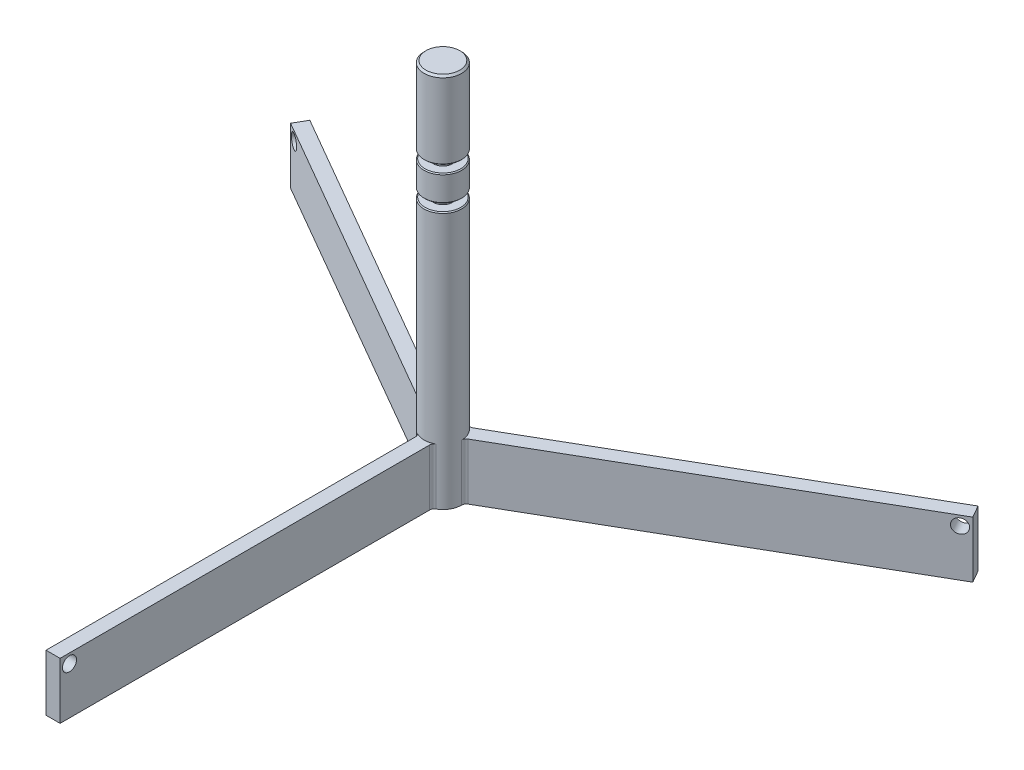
ISO-10303-21;
HEADER;
FILE_DESCRIPTION(('STEP AP214'),'2;1');
FILE_NAME('part.step','',(''),(''),'','','');
FILE_SCHEMA(('AUTOMOTIVE_DESIGN { 1 0 10303 214 1 1 1 1 }'));
ENDSEC;
DATA;
#1=APPLICATION_CONTEXT('core data for automotive mechanical design processes');
#2=APPLICATION_PROTOCOL_DEFINITION('international standard','automotive_design',2000,#1);
#3=PRODUCT_CONTEXT('',#1,'mechanical');
#4=PRODUCT('Part','Part','',(#3));
#5=PRODUCT_RELATED_PRODUCT_CATEGORY('part','',(#4));
#6=PRODUCT_DEFINITION_FORMATION('','',#4);
#7=PRODUCT_DEFINITION_CONTEXT('part definition',#1,'design');
#8=PRODUCT_DEFINITION('design','',#6,#7);
#9=PRODUCT_DEFINITION_SHAPE('','',#8);
#10=(LENGTH_UNIT() NAMED_UNIT(*) SI_UNIT(.MILLI.,.METRE.));
#11=(NAMED_UNIT(*) PLANE_ANGLE_UNIT() SI_UNIT($,.RADIAN.));
#12=(NAMED_UNIT(*) SI_UNIT($,.STERADIAN.) SOLID_ANGLE_UNIT());
#13=UNCERTAINTY_MEASURE_WITH_UNIT(LENGTH_MEASURE(1.E-05),#10,'distance_accuracy_value','');
#14=(GEOMETRIC_REPRESENTATION_CONTEXT(3) GLOBAL_UNCERTAINTY_ASSIGNED_CONTEXT((#13)) GLOBAL_UNIT_ASSIGNED_CONTEXT((#10,
#11,#12)) REPRESENTATION_CONTEXT('',''));
#15=CARTESIAN_POINT('',(0.,0.,0.));
#16=DIRECTION('',(0.,0.,1.));
#17=DIRECTION('',(1.,0.,0.));
#18=AXIS2_PLACEMENT_3D('',#15,#16,#17);
#19=CARTESIAN_POINT('',(0.,112.38552238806,0.));
#20=DIRECTION('',(0.,1.,0.));
#21=DIRECTION('',(0.,0.,1.));
#22=AXIS2_PLACEMENT_3D('',#19,#20,#21);
#23=CYLINDRICAL_SURFACE('',#22,12.7);
#24=CARTESIAN_POINT('',(0.,173.355,0.));
#25=DIRECTION('',(0.,-1.,0.));
#26=DIRECTION('',(0.,0.,-1.));
#27=AXIS2_PLACEMENT_3D('',#24,#25,#26);
#28=CIRCLE('',#27,12.7);
#29=CARTESIAN_POINT('',(0.,173.355,-12.7));
#30=VERTEX_POINT('',#29);
#31=EDGE_CURVE('E317',#30,#30,#28,.T.);
#32=ORIENTED_EDGE('',*,*,#31,.T.);
#33=EDGE_LOOP('',(#32));
#34=FACE_BOUND('',#33,.T.);
#35=CARTESIAN_POINT('',(0.,38.1,0.));
#36=DIRECTION('',(0.,-1.,0.));
#37=DIRECTION('',(0.,0.,-1.));
#38=AXIS2_PLACEMENT_3D('',#35,#36,#37);
#39=CIRCLE('',#38,12.7);
#40=CARTESIAN_POINT('',(6.35000000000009,38.1,-10.9985226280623));
#41=VERTEX_POINT('',#40);
#42=CARTESIAN_POINT('',(12.7,38.1,1.17961196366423E-13));
#43=VERTEX_POINT('',#42);
#44=EDGE_CURVE('E274',#41,#43,#39,.T.);
#45=ORIENTED_EDGE('',*,*,#44,.F.);
#46=DIRECTION('',(0.,1.,0.));
#47=VECTOR('',#46,1.);
#48=CARTESIAN_POINT('',(6.35000000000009,112.38552238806,-10.9985226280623));
#49=LINE('',#48,#47);
#50=CARTESIAN_POINT('',(6.35000000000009,0.,-10.9985226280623));
#51=VERTEX_POINT('',#50);
#52=EDGE_CURVE('E304',#41,#51,#49,.F.);
#53=ORIENTED_EDGE('',*,*,#52,.T.);
#54=CARTESIAN_POINT('',(0.,0.,0.));
#55=DIRECTION('',(0.,1.,0.));
#56=DIRECTION('',(0.,0.,1.));
#57=AXIS2_PLACEMENT_3D('',#54,#55,#56);
#58=CIRCLE('',#57,12.7);
#59=CARTESIAN_POINT('',(-6.34999999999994,0.,-10.9985226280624));
#60=VERTEX_POINT('',#59);
#61=EDGE_CURVE('E239',#51,#60,#58,.T.);
#62=ORIENTED_EDGE('',*,*,#61,.T.);
#63=DIRECTION('',(0.,1.,0.));
#64=VECTOR('',#63,1.);
#65=CARTESIAN_POINT('',(-6.34999999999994,112.38552238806,-10.9985226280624));
#66=LINE('',#65,#64);
#67=CARTESIAN_POINT('',(-6.34999999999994,38.1,-10.9985226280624));
#68=VERTEX_POINT('',#67);
#69=EDGE_CURVE('E280',#60,#68,#66,.T.);
#70=ORIENTED_EDGE('',*,*,#69,.T.);
#71=CARTESIAN_POINT('',(-12.7,38.1,0.));
#72=VERTEX_POINT('',#71);
#73=EDGE_CURVE('E276',#72,#68,#39,.T.);
#74=ORIENTED_EDGE('',*,*,#73,.F.);
#75=DIRECTION('',(0.,1.,0.));
#76=VECTOR('',#75,1.);
#77=CARTESIAN_POINT('',(-12.7,112.38552238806,0.));
#78=LINE('',#77,#76);
#79=CARTESIAN_POINT('',(-12.7,0.,0.));
#80=VERTEX_POINT('',#79);
#81=EDGE_CURVE('E283',#72,#80,#78,.F.);
#82=ORIENTED_EDGE('',*,*,#81,.T.);
#83=CARTESIAN_POINT('',(-6.35,0.,10.9985226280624));
#84=VERTEX_POINT('',#83);
#85=EDGE_CURVE('E234',#80,#84,#58,.T.);
#86=ORIENTED_EDGE('',*,*,#85,.T.);
#87=DIRECTION('',(0.,1.,0.));
#88=VECTOR('',#87,1.);
#89=CARTESIAN_POINT('',(-6.35,112.38552238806,10.9985226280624));
#90=LINE('',#89,#88);
#91=CARTESIAN_POINT('',(-6.35,38.1,10.9985226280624));
#92=VERTEX_POINT('',#91);
#93=EDGE_CURVE('E256',#84,#92,#90,.T.);
#94=ORIENTED_EDGE('',*,*,#93,.T.);
#95=CARTESIAN_POINT('',(0.,38.1,0.));
#96=DIRECTION('',(0.,-1.,0.));
#97=DIRECTION('',(0.,0.,-1.));
#98=AXIS2_PLACEMENT_3D('',#95,#96,#97);
#99=CIRCLE('',#98,12.7);
#100=CARTESIAN_POINT('',(6.35,38.1,10.9985226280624));
#101=VERTEX_POINT('',#100);
#102=EDGE_CURVE('E251',#101,#92,#99,.T.);
#103=ORIENTED_EDGE('',*,*,#102,.F.);
#104=DIRECTION('',(0.,1.,0.));
#105=VECTOR('',#104,1.);
#106=CARTESIAN_POINT('',(6.35,112.38552238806,10.9985226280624));
#107=LINE('',#106,#105);
#108=CARTESIAN_POINT('',(6.35,0.,10.9985226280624));
#109=VERTEX_POINT('',#108);
#110=EDGE_CURVE('E259',#101,#109,#107,.F.);
#111=ORIENTED_EDGE('',*,*,#110,.T.);
#112=CARTESIAN_POINT('',(12.7,0.,1.17961196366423E-13));
#113=VERTEX_POINT('',#112);
#114=EDGE_CURVE('E235',#109,#113,#58,.T.);
#115=ORIENTED_EDGE('',*,*,#114,.T.);
#116=DIRECTION('',(0.,1.,0.));
#117=VECTOR('',#116,1.);
#118=CARTESIAN_POINT('',(12.7,112.38552238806,1.17961196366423E-13));
#119=LINE('',#118,#117);
#120=EDGE_CURVE('E301',#113,#43,#119,.T.);
#121=ORIENTED_EDGE('',*,*,#120,.T.);
#122=EDGE_LOOP('',(#45,#53,#62,#70,#74,#82,#86,#94,#103,#111,#115,#121));
#123=FACE_BOUND('',#122,.T.);
#124=ADVANCED_FACE('F32',(#34,#123),#23,.T.);
#125=CARTESIAN_POINT('',(0.,254.,0.));
#126=DIRECTION('',(0.,-1.,0.));
#127=DIRECTION('',(0.,0.,-1.));
#128=AXIS2_PLACEMENT_3D('',#125,#126,#127);
#129=PLANE('',#128);
#130=CARTESIAN_POINT('',(0.,254.,0.));
#131=DIRECTION('',(0.,-1.,0.));
#132=DIRECTION('',(0.,0.,-1.));
#133=AXIS2_PLACEMENT_3D('',#130,#131,#132);
#134=CIRCLE('',#133,11.43);
#135=CARTESIAN_POINT('',(0.,254.,-11.43));
#136=VERTEX_POINT('',#135);
#137=EDGE_CURVE('E40',#136,#136,#134,.F.);
#138=ORIENTED_EDGE('',*,*,#137,.T.);
#139=EDGE_LOOP('',(#138));
#140=FACE_BOUND('',#139,.T.);
#141=ADVANCED_FACE('F34',(#140),#129,.F.);
#142=CARTESIAN_POINT('',(0.,112.38552238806,0.));
#143=DIRECTION('',(0.,1.,0.));
#144=DIRECTION('',(0.,0.,1.));
#145=AXIS2_PLACEMENT_3D('',#142,#143,#144);
#146=CYLINDRICAL_SURFACE('',#145,12.7);
#147=CARTESIAN_POINT('',(0.,252.73,0.));
#148=DIRECTION('',(0.,-1.,0.));
#149=DIRECTION('',(0.,0.,-1.));
#150=AXIS2_PLACEMENT_3D('',#147,#148,#149);
#151=CIRCLE('',#150,12.7);
#152=CARTESIAN_POINT('',(0.,252.73,-12.7));
#153=VERTEX_POINT('',#152);
#154=EDGE_CURVE('E11',#153,#153,#151,.T.);
#155=ORIENTED_EDGE('',*,*,#154,.T.);
#156=EDGE_LOOP('',(#155));
#157=FACE_BOUND('',#156,.T.);
#158=CARTESIAN_POINT('',(0.,202.311,0.));
#159=DIRECTION('',(0.,1.,0.));
#160=DIRECTION('',(0.,0.,1.));
#161=AXIS2_PLACEMENT_3D('',#158,#159,#160);
#162=CIRCLE('',#161,12.7);
#163=CARTESIAN_POINT('',(0.,202.311,12.7));
#164=VERTEX_POINT('',#163);
#165=EDGE_CURVE('E332',#164,#164,#162,.T.);
#166=ORIENTED_EDGE('',*,*,#165,.T.);
#167=EDGE_LOOP('',(#166));
#168=FACE_BOUND('',#167,.T.);
#169=ADVANCED_FACE('F359',(#157,#168),#146,.T.);
#170=CARTESIAN_POINT('',(6.35,201.676,0.));
#171=DIRECTION('',(0.,1.,0.));
#172=DIRECTION('',(0.,0.,1.));
#173=AXIS2_PLACEMENT_3D('',#170,#171,#172);
#174=PLANE('',#173);
#175=CARTESIAN_POINT('',(0.,201.676,0.));
#176=DIRECTION('',(0.,1.,0.));
#177=DIRECTION('',(0.,0.,1.));
#178=AXIS2_PLACEMENT_3D('',#175,#176,#177);
#179=CIRCLE('',#178,12.065);
#180=CARTESIAN_POINT('',(0.,201.676,12.065));
#181=VERTEX_POINT('',#180);
#182=EDGE_CURVE('E335',#181,#181,#179,.F.);
#183=ORIENTED_EDGE('',*,*,#182,.T.);
#184=EDGE_LOOP('',(#183));
#185=FACE_BOUND('',#184,.T.);
#186=CARTESIAN_POINT('',(0.,201.676,0.));
#187=DIRECTION('',(0.,1.,0.));
#188=DIRECTION('',(0.,0.,1.));
#189=AXIS2_PLACEMENT_3D('',#186,#187,#188);
#190=CIRCLE('',#189,6.35);
#191=CARTESIAN_POINT('',(0.,201.676,6.35));
#192=VERTEX_POINT('',#191);
#193=EDGE_CURVE('E248',#192,#192,#190,.T.);
#194=ORIENTED_EDGE('',*,*,#193,.T.);
#195=EDGE_LOOP('',(#194));
#196=FACE_BOUND('',#195,.T.);
#197=ADVANCED_FACE('F387',(#185,#196),#174,.F.);
#198=CARTESIAN_POINT('',(0.,112.38552238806,0.));
#199=DIRECTION('',(0.,1.,0.));
#200=DIRECTION('',(0.,0.,1.));
#201=AXIS2_PLACEMENT_3D('',#198,#199,#200);
#202=CYLINDRICAL_SURFACE('',#201,6.35);
#203=ORIENTED_EDGE('',*,*,#193,.F.);
#204=EDGE_LOOP('',(#203));
#205=FACE_BOUND('',#204,.T.);
#206=CARTESIAN_POINT('',(0.,196.596,0.));
#207=DIRECTION('',(0.,1.,0.));
#208=DIRECTION('',(0.,0.,1.));
#209=AXIS2_PLACEMENT_3D('',#206,#207,#208);
#210=CIRCLE('',#209,6.35);
#211=CARTESIAN_POINT('',(0.,196.596,6.35));
#212=VERTEX_POINT('',#211);
#213=EDGE_CURVE('E245',#212,#212,#210,.T.);
#214=ORIENTED_EDGE('',*,*,#213,.T.);
#215=EDGE_LOOP('',(#214));
#216=FACE_BOUND('',#215,.T.);
#217=ADVANCED_FACE('F383',(#205,#216),#202,.T.);
#218=CARTESIAN_POINT('',(12.7,196.596,0.));
#219=DIRECTION('',(0.,-1.,0.));
#220=DIRECTION('',(0.,0.,-1.));
#221=AXIS2_PLACEMENT_3D('',#218,#219,#220);
#222=PLANE('',#221);
#223=CARTESIAN_POINT('',(0.,196.596,0.));
#224=DIRECTION('',(0.,-1.,0.));
#225=DIRECTION('',(0.,0.,-1.));
#226=AXIS2_PLACEMENT_3D('',#223,#224,#225);
#227=CIRCLE('',#226,12.065);
#228=CARTESIAN_POINT('',(0.,196.596,-12.065));
#229=VERTEX_POINT('',#228);
#230=EDGE_CURVE('E329',#229,#229,#227,.F.);
#231=ORIENTED_EDGE('',*,*,#230,.T.);
#232=EDGE_LOOP('',(#231));
#233=FACE_BOUND('',#232,.T.);
#234=ORIENTED_EDGE('',*,*,#213,.F.);
#235=EDGE_LOOP('',(#234));
#236=FACE_BOUND('',#235,.T.);
#237=ADVANCED_FACE('F379',(#233,#236),#222,.F.);
#238=CARTESIAN_POINT('',(0.,112.38552238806,0.));
#239=DIRECTION('',(0.,1.,0.));
#240=DIRECTION('',(0.,0.,1.));
#241=AXIS2_PLACEMENT_3D('',#238,#239,#240);
#242=CYLINDRICAL_SURFACE('',#241,12.7);
#243=CARTESIAN_POINT('',(0.,179.705,0.));
#244=DIRECTION('',(0.,1.,0.));
#245=DIRECTION('',(0.,0.,1.));
#246=AXIS2_PLACEMENT_3D('',#243,#244,#245);
#247=CIRCLE('',#246,12.7);
#248=CARTESIAN_POINT('',(0.,179.705,12.7));
#249=VERTEX_POINT('',#248);
#250=EDGE_CURVE('E323',#249,#249,#247,.T.);
#251=ORIENTED_EDGE('',*,*,#250,.T.);
#252=EDGE_LOOP('',(#251));
#253=FACE_BOUND('',#252,.T.);
#254=CARTESIAN_POINT('',(0.,195.961,0.));
#255=DIRECTION('',(0.,-1.,0.));
#256=DIRECTION('',(0.,0.,-1.));
#257=AXIS2_PLACEMENT_3D('',#254,#255,#256);
#258=CIRCLE('',#257,12.7);
#259=CARTESIAN_POINT('',(0.,195.961,-12.7));
#260=VERTEX_POINT('',#259);
#261=EDGE_CURVE('E320',#260,#260,#258,.T.);
#262=ORIENTED_EDGE('',*,*,#261,.T.);
#263=EDGE_LOOP('',(#262));
#264=FACE_BOUND('',#263,.T.);
#265=ADVANCED_FACE('F375',(#253,#264),#242,.T.);
#266=CARTESIAN_POINT('',(6.35,179.07,0.));
#267=DIRECTION('',(0.,1.,0.));
#268=DIRECTION('',(0.,0.,1.));
#269=AXIS2_PLACEMENT_3D('',#266,#267,#268);
#270=PLANE('',#269);
#271=CARTESIAN_POINT('',(0.,179.07,0.));
#272=DIRECTION('',(0.,1.,0.));
#273=DIRECTION('',(0.,0.,1.));
#274=AXIS2_PLACEMENT_3D('',#271,#272,#273);
#275=CIRCLE('',#274,12.065);
#276=CARTESIAN_POINT('',(0.,179.07,12.065));
#277=VERTEX_POINT('',#276);
#278=EDGE_CURVE('E326',#277,#277,#275,.F.);
#279=ORIENTED_EDGE('',*,*,#278,.T.);
#280=EDGE_LOOP('',(#279));
#281=FACE_BOUND('',#280,.T.);
#282=CARTESIAN_POINT('',(0.,179.07,0.));
#283=DIRECTION('',(0.,1.,0.));
#284=DIRECTION('',(0.,0.,1.));
#285=AXIS2_PLACEMENT_3D('',#282,#283,#284);
#286=CIRCLE('',#285,6.35);
#287=CARTESIAN_POINT('',(0.,179.07,6.35));
#288=VERTEX_POINT('',#287);
#289=EDGE_CURVE('E242',#288,#288,#286,.T.);
#290=ORIENTED_EDGE('',*,*,#289,.T.);
#291=EDGE_LOOP('',(#290));
#292=FACE_BOUND('',#291,.T.);
#293=ADVANCED_FACE('F371',(#281,#292),#270,.F.);
#294=CARTESIAN_POINT('',(0.,112.38552238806,0.));
#295=DIRECTION('',(0.,1.,0.));
#296=DIRECTION('',(0.,0.,1.));
#297=AXIS2_PLACEMENT_3D('',#294,#295,#296);
#298=CYLINDRICAL_SURFACE('',#297,6.35);
#299=ORIENTED_EDGE('',*,*,#289,.F.);
#300=EDGE_LOOP('',(#299));
#301=FACE_BOUND('',#300,.T.);
#302=CARTESIAN_POINT('',(0.,173.99,0.));
#303=DIRECTION('',(0.,1.,0.));
#304=DIRECTION('',(0.,0.,1.));
#305=AXIS2_PLACEMENT_3D('',#302,#303,#304);
#306=CIRCLE('',#305,6.35);
#307=CARTESIAN_POINT('',(0.,173.99,6.35));
#308=VERTEX_POINT('',#307);
#309=EDGE_CURVE('E238',#308,#308,#306,.T.);
#310=ORIENTED_EDGE('',*,*,#309,.T.);
#311=EDGE_LOOP('',(#310));
#312=FACE_BOUND('',#311,.T.);
#313=ADVANCED_FACE('F367',(#301,#312),#298,.T.);
#314=CARTESIAN_POINT('',(12.7,173.99,0.));
#315=DIRECTION('',(0.,-1.,0.));
#316=DIRECTION('',(0.,0.,-1.));
#317=AXIS2_PLACEMENT_3D('',#314,#315,#316);
#318=PLANE('',#317);
#319=CARTESIAN_POINT('',(0.,173.99,0.));
#320=DIRECTION('',(0.,-1.,0.));
#321=DIRECTION('',(0.,0.,-1.));
#322=AXIS2_PLACEMENT_3D('',#319,#320,#321);
#323=CIRCLE('',#322,12.065);
#324=CARTESIAN_POINT('',(0.,173.99,-12.065));
#325=VERTEX_POINT('',#324);
#326=EDGE_CURVE('E314',#325,#325,#323,.F.);
#327=ORIENTED_EDGE('',*,*,#326,.T.);
#328=EDGE_LOOP('',(#327));
#329=FACE_BOUND('',#328,.T.);
#330=ORIENTED_EDGE('',*,*,#309,.F.);
#331=EDGE_LOOP('',(#330));
#332=FACE_BOUND('',#331,.T.);
#333=ADVANCED_FACE('F364',(#329,#332),#318,.F.);
#334=CARTESIAN_POINT('',(0.,0.,0.));
#335=DIRECTION('',(0.,1.,0.));
#336=DIRECTION('',(0.,0.,1.));
#337=AXIS2_PLACEMENT_3D('',#334,#335,#336);
#338=PLANE('',#337);
#339=ORIENTED_EDGE('',*,*,#85,.F.);
#340=CARTESIAN_POINT('',(-15.875,0.,0.));
#341=DIRECTION('',(0.,1.,0.));
#342=DIRECTION('',(0.,0.,1.));
#343=AXIS2_PLACEMENT_3D('',#340,#341,#342);
#344=CIRCLE('',#343,3.175);
#345=CARTESIAN_POINT('',(-14.2875,0.,-2.74963065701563));
#346=VERTEX_POINT('',#345);
#347=EDGE_CURVE('E291',#80,#346,#344,.T.);
#348=ORIENTED_EDGE('',*,*,#347,.T.);
#349=DIRECTION('',(0.866025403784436,0.,0.500000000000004));
#350=VECTOR('',#349,1.);
#351=CARTESIAN_POINT('',(-230.600594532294,0.,-127.638054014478));
#352=LINE('',#351,#350);
#353=CARTESIAN_POINT('',(-230.600594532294,0.,-127.638054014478));
#354=VERTEX_POINT('',#353);
#355=EDGE_CURVE('E201',#354,#346,#352,.T.);
#356=ORIENTED_EDGE('',*,*,#355,.F.);
#357=DIRECTION('',(-0.500000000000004,0.,0.866025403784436));
#358=VECTOR('',#357,1.);
#359=CARTESIAN_POINT('',(-225.838094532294,0.,-135.886945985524));
#360=LINE('',#359,#358);
#361=CARTESIAN_POINT('',(-225.838094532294,0.,-135.886945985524));
#362=VERTEX_POINT('',#361);
#363=EDGE_CURVE('E184',#362,#354,#360,.T.);
#364=ORIENTED_EDGE('',*,*,#363,.F.);
#365=DIRECTION('',(0.866025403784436,0.,0.500000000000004));
#366=VECTOR('',#365,1.);
#367=CARTESIAN_POINT('',(-225.838094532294,0.,-135.886945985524));
#368=LINE('',#367,#366);
#369=CARTESIAN_POINT('',(-9.5249999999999,0.,-10.9985226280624));
#370=VERTEX_POINT('',#369);
#371=EDGE_CURVE('E204',#362,#370,#368,.T.);
#372=ORIENTED_EDGE('',*,*,#371,.T.);
#373=CARTESIAN_POINT('',(-7.93749999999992,0.,-13.748153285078));
#374=DIRECTION('',(0.,1.,0.));
#375=DIRECTION('',(0.,0.,1.));
#376=AXIS2_PLACEMENT_3D('',#373,#374,#375);
#377=CIRCLE('',#376,3.175);
#378=EDGE_CURVE('E293',#370,#60,#377,.T.);
#379=ORIENTED_EDGE('',*,*,#378,.T.);
#380=ORIENTED_EDGE('',*,*,#61,.F.);
#381=CARTESIAN_POINT('',(7.93750000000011,0.,-13.7481532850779));
#382=DIRECTION('',(0.,1.,0.));
#383=DIRECTION('',(0.,0.,1.));
#384=AXIS2_PLACEMENT_3D('',#381,#382,#383);
#385=CIRCLE('',#384,3.175);
#386=CARTESIAN_POINT('',(9.52500000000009,0.,-10.9985226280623));
#387=VERTEX_POINT('',#386);
#388=EDGE_CURVE('E310',#51,#387,#385,.T.);
#389=ORIENTED_EDGE('',*,*,#388,.T.);
#390=DIRECTION('',(-0.866025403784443,0.,0.499999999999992));
#391=VECTOR('',#390,1.);
#392=CARTESIAN_POINT('',(225.838094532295,0.,-135.886945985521));
#393=LINE('',#392,#391);
#394=CARTESIAN_POINT('',(225.838094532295,0.,-135.886945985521));
#395=VERTEX_POINT('',#394);
#396=EDGE_CURVE('E166',#395,#387,#393,.T.);
#397=ORIENTED_EDGE('',*,*,#396,.F.);
#398=DIRECTION('',(-0.499999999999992,0.,-0.866025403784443));
#399=VECTOR('',#398,1.);
#400=CARTESIAN_POINT('',(230.600594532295,0.,-127.638054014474));
#401=LINE('',#400,#399);
#402=CARTESIAN_POINT('',(230.600594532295,0.,-127.638054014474));
#403=VERTEX_POINT('',#402);
#404=EDGE_CURVE('E159',#403,#395,#401,.T.);
#405=ORIENTED_EDGE('',*,*,#404,.F.);
#406=DIRECTION('',(-0.866025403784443,0.,0.499999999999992));
#407=VECTOR('',#406,1.);
#408=CARTESIAN_POINT('',(230.600594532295,0.,-127.638054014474));
#409=LINE('',#408,#407);
#410=CARTESIAN_POINT('',(14.2875,0.,-2.74963065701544));
#411=VERTEX_POINT('',#410);
#412=EDGE_CURVE('E164',#403,#411,#409,.T.);
#413=ORIENTED_EDGE('',*,*,#412,.T.);
#414=CARTESIAN_POINT('',(15.875,0.,1.47451495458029E-13));
#415=DIRECTION('',(0.,1.,0.));
#416=DIRECTION('',(0.,0.,1.));
#417=AXIS2_PLACEMENT_3D('',#414,#415,#416);
#418=CIRCLE('',#417,3.175);
#419=EDGE_CURVE('E47',#411,#113,#418,.T.);
#420=ORIENTED_EDGE('',*,*,#419,.T.);
#421=ORIENTED_EDGE('',*,*,#114,.F.);
#422=CARTESIAN_POINT('',(7.9375,0.,13.748153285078));
#423=DIRECTION('',(0.,1.,0.));
#424=DIRECTION('',(0.,0.,1.));
#425=AXIS2_PLACEMENT_3D('',#422,#423,#424);
#426=CIRCLE('',#425,3.175);
#427=CARTESIAN_POINT('',(4.7625,0.,13.748153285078));
#428=VERTEX_POINT('',#427);
#429=EDGE_CURVE('E267',#109,#428,#426,.T.);
#430=ORIENTED_EDGE('',*,*,#429,.T.);
#431=DIRECTION('',(0.,0.,-1.));
#432=VECTOR('',#431,1.);
#433=CARTESIAN_POINT('',(4.7625,0.,263.525));
#434=LINE('',#433,#432);
#435=CARTESIAN_POINT('',(4.7625,0.,263.525));
#436=VERTEX_POINT('',#435);
#437=EDGE_CURVE('E228',#436,#428,#434,.T.);
#438=ORIENTED_EDGE('',*,*,#437,.F.);
#439=DIRECTION('',(1.,0.,0.));
#440=VECTOR('',#439,1.);
#441=CARTESIAN_POINT('',(-4.7625,0.,263.525));
#442=LINE('',#441,#440);
#443=CARTESIAN_POINT('',(-4.7625,0.,263.525));
#444=VERTEX_POINT('',#443);
#445=EDGE_CURVE('E216',#444,#436,#442,.T.);
#446=ORIENTED_EDGE('',*,*,#445,.F.);
#447=DIRECTION('',(0.,0.,-1.));
#448=VECTOR('',#447,1.);
#449=CARTESIAN_POINT('',(-4.7625,0.,263.525));
#450=LINE('',#449,#448);
#451=CARTESIAN_POINT('',(-4.7625,0.,13.748153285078));
#452=VERTEX_POINT('',#451);
#453=EDGE_CURVE('E231',#444,#452,#450,.T.);
#454=ORIENTED_EDGE('',*,*,#453,.T.);
#455=CARTESIAN_POINT('',(-7.9375,0.,13.748153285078));
#456=DIRECTION('',(0.,1.,0.));
#457=DIRECTION('',(0.,0.,1.));
#458=AXIS2_PLACEMENT_3D('',#455,#456,#457);
#459=CIRCLE('',#458,3.175);
#460=EDGE_CURVE('E269',#452,#84,#459,.T.);
#461=ORIENTED_EDGE('',*,*,#460,.T.);
#462=EDGE_LOOP('',(#339,#348,#356,#364,#372,#379,#380,#389,#397,#405,#413,#420,#421,#430,#438,
#446,#454,#461));
#463=FACE_BOUND('',#462,.T.);
#464=ADVANCED_FACE('F162',(#463),#338,.F.);
#465=CARTESIAN_POINT('',(-4.7625,38.1,263.525));
#466=DIRECTION('',(0.,-1.,0.));
#467=DIRECTION('',(0.,0.,-1.));
#468=AXIS2_PLACEMENT_3D('',#465,#466,#467);
#469=PLANE('',#468);
#470=DIRECTION('',(0.,0.,-1.));
#471=VECTOR('',#470,1.);
#472=CARTESIAN_POINT('',(4.7625,38.1,263.525));
#473=LINE('',#472,#471);
#474=CARTESIAN_POINT('',(4.7625,38.1,263.525));
#475=VERTEX_POINT('',#474);
#476=CARTESIAN_POINT('',(4.7625,38.1,13.748153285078));
#477=VERTEX_POINT('',#476);
#478=EDGE_CURVE('E225',#475,#477,#473,.T.);
#479=ORIENTED_EDGE('',*,*,#478,.T.);
#480=CARTESIAN_POINT('',(7.9375,38.1,13.748153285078));
#481=DIRECTION('',(0.,-1.,0.));
#482=DIRECTION('',(0.,0.,-1.));
#483=AXIS2_PLACEMENT_3D('',#480,#481,#482);
#484=CIRCLE('',#483,3.175);
#485=EDGE_CURVE('E264',#477,#101,#484,.T.);
#486=ORIENTED_EDGE('',*,*,#485,.T.);
#487=ORIENTED_EDGE('',*,*,#102,.T.);
#488=CARTESIAN_POINT('',(-7.9375,38.1,13.748153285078));
#489=DIRECTION('',(0.,-1.,0.));
#490=DIRECTION('',(0.,0.,-1.));
#491=AXIS2_PLACEMENT_3D('',#488,#489,#490);
#492=CIRCLE('',#491,3.175);
#493=CARTESIAN_POINT('',(-4.7625,38.1,13.748153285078));
#494=VERTEX_POINT('',#493);
#495=EDGE_CURVE('E272',#92,#494,#492,.T.);
#496=ORIENTED_EDGE('',*,*,#495,.T.);
#497=DIRECTION('',(0.,0.,-1.));
#498=VECTOR('',#497,1.);
#499=CARTESIAN_POINT('',(-4.7625,38.1,263.525));
#500=LINE('',#499,#498);
#501=CARTESIAN_POINT('',(-4.7625,38.1,263.525));
#502=VERTEX_POINT('',#501);
#503=EDGE_CURVE('E222',#502,#494,#500,.T.);
#504=ORIENTED_EDGE('',*,*,#503,.F.);
#505=DIRECTION('',(-1.,0.,0.));
#506=VECTOR('',#505,1.);
#507=CARTESIAN_POINT('',(-4.7625,38.1,263.525));
#508=LINE('',#507,#506);
#509=EDGE_CURVE('E220',#475,#502,#508,.T.);
#510=ORIENTED_EDGE('',*,*,#509,.F.);
#511=EDGE_LOOP('',(#479,#486,#487,#496,#504,#510));
#512=FACE_BOUND('',#511,.T.);
#513=ADVANCED_FACE('F436',(#512),#469,.F.);
#514=CARTESIAN_POINT('',(-4.7625,0.,263.525));
#515=DIRECTION('',(1.,0.,0.));
#516=DIRECTION('',(0.,1.,0.));
#517=AXIS2_PLACEMENT_3D('',#514,#515,#516);
#518=PLANE('',#517);
#519=CARTESIAN_POINT('',(-4.7625,31.75,257.175));
#520=DIRECTION('',(1.,0.,0.));
#521=DIRECTION('',(0.,1.,0.));
#522=AXIS2_PLACEMENT_3D('',#519,#520,#521);
#523=CIRCLE('',#522,4.76250000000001);
#524=CARTESIAN_POINT('',(-4.7625,36.5125,257.175));
#525=VERTEX_POINT('',#524);
#526=EDGE_CURVE('E210',#525,#525,#523,.T.);
#527=ORIENTED_EDGE('',*,*,#526,.T.);
#528=EDGE_LOOP('',(#527));
#529=FACE_BOUND('',#528,.T.);
#530=ORIENTED_EDGE('',*,*,#503,.T.);
#531=DIRECTION('',(0.,-1.,0.));
#532=VECTOR('',#531,1.);
#533=CARTESIAN_POINT('',(-4.7625,0.,13.748153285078));
#534=LINE('',#533,#532);
#535=EDGE_CURVE('E261',#494,#452,#534,.T.);
#536=ORIENTED_EDGE('',*,*,#535,.T.);
#537=ORIENTED_EDGE('',*,*,#453,.F.);
#538=DIRECTION('',(0.,-1.,0.));
#539=VECTOR('',#538,1.);
#540=CARTESIAN_POINT('',(-4.7625,0.,263.525));
#541=LINE('',#540,#539);
#542=EDGE_CURVE('E213',#502,#444,#541,.T.);
#543=ORIENTED_EDGE('',*,*,#542,.F.);
#544=EDGE_LOOP('',(#530,#536,#537,#543));
#545=FACE_BOUND('',#544,.T.);
#546=ADVANCED_FACE('F444',(#529,#545),#518,.F.);
#547=CARTESIAN_POINT('',(4.7625,0.,263.525));
#548=DIRECTION('',(-1.,0.,0.));
#549=DIRECTION('',(0.,-1.,0.));
#550=AXIS2_PLACEMENT_3D('',#547,#548,#549);
#551=PLANE('',#550);
#552=CARTESIAN_POINT('',(4.7625,31.75,257.175));
#553=DIRECTION('',(1.,0.,0.));
#554=DIRECTION('',(0.,1.,0.));
#555=AXIS2_PLACEMENT_3D('',#552,#553,#554);
#556=CIRCLE('',#555,4.76250000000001);
#557=CARTESIAN_POINT('',(4.7625,36.5125,257.175));
#558=VERTEX_POINT('',#557);
#559=EDGE_CURVE('E207',#558,#558,#556,.T.);
#560=ORIENTED_EDGE('',*,*,#559,.F.);
#561=EDGE_LOOP('',(#560));
#562=FACE_BOUND('',#561,.T.);
#563=ORIENTED_EDGE('',*,*,#437,.T.);
#564=DIRECTION('',(0.,-1.,0.));
#565=VECTOR('',#564,1.);
#566=CARTESIAN_POINT('',(4.7625,38.1,13.748153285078));
#567=LINE('',#566,#565);
#568=EDGE_CURVE('E253',#428,#477,#567,.F.);
#569=ORIENTED_EDGE('',*,*,#568,.T.);
#570=ORIENTED_EDGE('',*,*,#478,.F.);
#571=DIRECTION('',(0.,1.,0.));
#572=VECTOR('',#571,1.);
#573=CARTESIAN_POINT('',(4.7625,0.,263.525));
#574=LINE('',#573,#572);
#575=EDGE_CURVE('E218',#436,#475,#574,.T.);
#576=ORIENTED_EDGE('',*,*,#575,.F.);
#577=EDGE_LOOP('',(#563,#569,#570,#576));
#578=FACE_BOUND('',#577,.T.);
#579=ADVANCED_FACE('F453',(#562,#578),#551,.F.);
#580=CARTESIAN_POINT('',(-4.7625,38.1,263.525));
#581=DIRECTION('',(0.,0.,-1.));
#582=DIRECTION('',(-1.,0.,0.));
#583=AXIS2_PLACEMENT_3D('',#580,#581,#582);
#584=PLANE('',#583);
#585=ORIENTED_EDGE('',*,*,#542,.T.);
#586=ORIENTED_EDGE('',*,*,#445,.T.);
#587=ORIENTED_EDGE('',*,*,#575,.T.);
#588=ORIENTED_EDGE('',*,*,#509,.T.);
#589=EDGE_LOOP('',(#585,#586,#587,#588));
#590=FACE_BOUND('',#589,.T.);
#591=ADVANCED_FACE('F460',(#590),#584,.F.);
#592=CARTESIAN_POINT('',(-12.7,31.75,257.175));
#593=DIRECTION('',(1.,0.,0.));
#594=DIRECTION('',(0.,1.,0.));
#595=AXIS2_PLACEMENT_3D('',#592,#593,#594);
#596=CYLINDRICAL_SURFACE('',#595,4.76250000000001);
#597=ORIENTED_EDGE('',*,*,#559,.T.);
#598=EDGE_LOOP('',(#597));
#599=FACE_BOUND('',#598,.T.);
#600=ORIENTED_EDGE('',*,*,#526,.F.);
#601=EDGE_LOOP('',(#600));
#602=FACE_BOUND('',#601,.T.);
#603=ADVANCED_FACE('F468',(#599,#602),#596,.F.);
#604=CARTESIAN_POINT('',(7.9375,112.38552238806,13.748153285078));
#605=DIRECTION('',(0.,1.,0.));
#606=DIRECTION('',(0.,0.,1.));
#607=AXIS2_PLACEMENT_3D('',#604,#605,#606);
#608=CYLINDRICAL_SURFACE('',#607,3.175);
#609=ORIENTED_EDGE('',*,*,#429,.F.);
#610=ORIENTED_EDGE('',*,*,#110,.F.);
#611=ORIENTED_EDGE('',*,*,#485,.F.);
#612=ORIENTED_EDGE('',*,*,#568,.F.);
#613=EDGE_LOOP('',(#609,#610,#611,#612));
#614=FACE_BOUND('',#613,.T.);
#615=ADVANCED_FACE('F475',(#614),#608,.F.);
#616=CARTESIAN_POINT('',(-7.9375,112.38552238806,13.748153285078));
#617=DIRECTION('',(0.,1.,0.));
#618=DIRECTION('',(0.,0.,1.));
#619=AXIS2_PLACEMENT_3D('',#616,#617,#618);
#620=CYLINDRICAL_SURFACE('',#619,3.175);
#621=ORIENTED_EDGE('',*,*,#495,.F.);
#622=ORIENTED_EDGE('',*,*,#93,.F.);
#623=ORIENTED_EDGE('',*,*,#460,.F.);
#624=ORIENTED_EDGE('',*,*,#535,.F.);
#625=EDGE_LOOP('',(#621,#622,#623,#624));
#626=FACE_BOUND('',#625,.T.);
#627=ADVANCED_FACE('F482',(#626),#620,.F.);
#628=CARTESIAN_POINT('',(230.600594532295,38.1,-127.638054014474));
#629=DIRECTION('',(-0.866025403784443,0.,0.499999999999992));
#630=DIRECTION('',(0.499999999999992,0.,0.866025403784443));
#631=AXIS2_PLACEMENT_3D('',#628,#629,#630);
#632=PLANE('',#631);
#633=DIRECTION('',(0.,-1.,0.));
#634=VECTOR('',#633,1.);
#635=CARTESIAN_POINT('',(230.600594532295,0.,-127.638054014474));
#636=LINE('',#635,#634);
#637=CARTESIAN_POINT('',(230.600594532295,38.1,-127.638054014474));
#638=VERTEX_POINT('',#637);
#639=EDGE_CURVE('E170',#638,#403,#636,.T.);
#640=ORIENTED_EDGE('',*,*,#639,.T.);
#641=ORIENTED_EDGE('',*,*,#404,.T.);
#642=DIRECTION('',(0.,1.,0.));
#643=VECTOR('',#642,1.);
#644=CARTESIAN_POINT('',(225.838094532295,0.,-135.886945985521));
#645=LINE('',#644,#643);
#646=CARTESIAN_POINT('',(225.838094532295,38.1,-135.886945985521));
#647=VERTEX_POINT('',#646);
#648=EDGE_CURVE('E169',#395,#647,#645,.T.);
#649=ORIENTED_EDGE('',*,*,#648,.T.);
#650=DIRECTION('',(0.499999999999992,0.,0.866025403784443));
#651=VECTOR('',#650,1.);
#652=CARTESIAN_POINT('',(230.600594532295,38.1,-127.638054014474));
#653=LINE('',#652,#651);
#654=EDGE_CURVE('E175',#647,#638,#653,.T.);
#655=ORIENTED_EDGE('',*,*,#654,.T.);
#656=EDGE_LOOP('',(#640,#641,#649,#655));
#657=FACE_BOUND('',#656,.T.);
#658=ADVANCED_FACE('F173',(#657),#632,.F.);
#659=CARTESIAN_POINT('',(230.600594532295,0.,-127.638054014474));
#660=DIRECTION('',(-0.499999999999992,0.,-0.866025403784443));
#661=DIRECTION('',(-0.866025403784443,0.,0.499999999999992));
#662=AXIS2_PLACEMENT_3D('',#659,#660,#661);
#663=PLANE('',#662);
#664=CARTESIAN_POINT('',(225.101333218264,31.75,-124.463054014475));
#665=DIRECTION('',(-0.499999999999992,0.,-0.866025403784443));
#666=DIRECTION('',(-0.866025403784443,0.,0.499999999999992));
#667=AXIS2_PLACEMENT_3D('',#664,#665,#666);
#668=CIRCLE('',#667,4.76250000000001);
#669=CARTESIAN_POINT('',(220.976887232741,31.75,-122.081804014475));
#670=VERTEX_POINT('',#669);
#671=EDGE_CURVE('E784',#670,#670,#668,.T.);
#672=ORIENTED_EDGE('',*,*,#671,.T.);
#673=EDGE_LOOP('',(#672));
#674=FACE_BOUND('',#673,.T.);
#675=DIRECTION('',(-0.866025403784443,0.,0.499999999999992));
#676=VECTOR('',#675,1.);
#677=CARTESIAN_POINT('',(230.600594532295,38.1,-127.638054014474));
#678=LINE('',#677,#676);
#679=CARTESIAN_POINT('',(14.2875,38.1,-2.74963065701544));
#680=VERTEX_POINT('',#679);
#681=EDGE_CURVE('E774',#638,#680,#678,.T.);
#682=ORIENTED_EDGE('',*,*,#681,.T.);
#683=DIRECTION('',(0.,-1.,0.));
#684=VECTOR('',#683,1.);
#685=CARTESIAN_POINT('',(14.2875,0.,-2.74963065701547));
#686=LINE('',#685,#684);
#687=EDGE_CURVE('E180',#680,#411,#686,.T.);
#688=ORIENTED_EDGE('',*,*,#687,.T.);
#689=ORIENTED_EDGE('',*,*,#412,.F.);
#690=ORIENTED_EDGE('',*,*,#639,.F.);
#691=EDGE_LOOP('',(#682,#688,#689,#690));
#692=FACE_BOUND('',#691,.T.);
#693=ADVANCED_FACE('F179',(#674,#692),#663,.F.);
#694=CARTESIAN_POINT('',(225.838094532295,0.,-135.886945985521));
#695=DIRECTION('',(0.499999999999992,0.,0.866025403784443));
#696=DIRECTION('',(0.866025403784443,0.,-0.499999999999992));
#697=AXIS2_PLACEMENT_3D('',#694,#695,#696);
#698=PLANE('',#697);
#699=CARTESIAN_POINT('',(220.338833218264,31.75,-132.711945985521));
#700=DIRECTION('',(-0.499999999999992,0.,-0.866025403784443));
#701=DIRECTION('',(0.,1.,0.));
#702=AXIS2_PLACEMENT_3D('',#699,#700,#701);
#703=CIRCLE('',#702,4.76250000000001);
#704=CARTESIAN_POINT('',(220.338833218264,36.5125,-132.711945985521));
#705=VERTEX_POINT('',#704);
#706=EDGE_CURVE('E787',#705,#705,#703,.T.);
#707=ORIENTED_EDGE('',*,*,#706,.F.);
#708=EDGE_LOOP('',(#707));
#709=FACE_BOUND('',#708,.T.);
#710=ORIENTED_EDGE('',*,*,#396,.T.);
#711=DIRECTION('',(0.,-1.,0.));
#712=VECTOR('',#711,1.);
#713=CARTESIAN_POINT('',(9.52500000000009,38.1,-10.9985226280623));
#714=LINE('',#713,#712);
#715=CARTESIAN_POINT('',(9.52500000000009,38.1,-10.9985226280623));
#716=VERTEX_POINT('',#715);
#717=EDGE_CURVE('E298',#387,#716,#714,.F.);
#718=ORIENTED_EDGE('',*,*,#717,.T.);
#719=DIRECTION('',(-0.866025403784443,0.,0.499999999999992));
#720=VECTOR('',#719,1.);
#721=CARTESIAN_POINT('',(225.838094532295,38.1,-135.886945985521));
#722=LINE('',#721,#720);
#723=EDGE_CURVE('E186',#647,#716,#722,.T.);
#724=ORIENTED_EDGE('',*,*,#723,.F.);
#725=ORIENTED_EDGE('',*,*,#648,.F.);
#726=EDGE_LOOP('',(#710,#718,#724,#725));
#727=FACE_BOUND('',#726,.T.);
#728=ADVANCED_FACE('F501',(#709,#727),#698,.F.);
#729=CARTESIAN_POINT('',(-225.838094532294,38.1,-135.886945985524));
#730=DIRECTION('',(0.,-1.,0.));
#731=DIRECTION('',(0.,0.,-1.));
#732=AXIS2_PLACEMENT_3D('',#729,#730,#731);
#733=PLANE('',#732);
#734=ORIENTED_EDGE('',*,*,#723,.T.);
#735=CARTESIAN_POINT('',(7.93750000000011,38.1,-13.7481532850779));
#736=DIRECTION('',(0.,-1.,0.));
#737=DIRECTION('',(0.,0.,-1.));
#738=AXIS2_PLACEMENT_3D('',#735,#736,#737);
#739=CIRCLE('',#738,3.175);
#740=EDGE_CURVE('E307',#716,#41,#739,.T.);
#741=ORIENTED_EDGE('',*,*,#740,.T.);
#742=ORIENTED_EDGE('',*,*,#44,.T.);
#743=CARTESIAN_POINT('',(15.875,38.1,1.47451495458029E-13));
#744=DIRECTION('',(0.,-1.,0.));
#745=DIRECTION('',(0.,0.,-1.));
#746=AXIS2_PLACEMENT_3D('',#743,#744,#745);
#747=CIRCLE('',#746,3.175);
#748=EDGE_CURVE('E55',#43,#680,#747,.T.);
#749=ORIENTED_EDGE('',*,*,#748,.T.);
#750=ORIENTED_EDGE('',*,*,#681,.F.);
#751=ORIENTED_EDGE('',*,*,#654,.F.);
#752=EDGE_LOOP('',(#734,#741,#742,#749,#750,#751));
#753=FACE_BOUND('',#752,.T.);
#754=ADVANCED_FACE('F509',(#753),#733,.F.);
#755=DIRECTION('',(0.866025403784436,0.,0.500000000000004));
#756=VECTOR('',#755,1.);
#757=CARTESIAN_POINT('',(-230.600594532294,38.1,-127.638054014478));
#758=LINE('',#757,#756);
#759=CARTESIAN_POINT('',(-230.600594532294,38.1,-127.638054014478));
#760=VERTEX_POINT('',#759);
#761=CARTESIAN_POINT('',(-14.2875,38.1,-2.74963065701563));
#762=VERTEX_POINT('',#761);
#763=EDGE_CURVE('E198',#760,#762,#758,.T.);
#764=ORIENTED_EDGE('',*,*,#763,.T.);
#765=CARTESIAN_POINT('',(-15.875,38.1,0.));
#766=DIRECTION('',(0.,-1.,0.));
#767=DIRECTION('',(0.,0.,-1.));
#768=AXIS2_PLACEMENT_3D('',#765,#766,#767);
#769=CIRCLE('',#768,3.175);
#770=EDGE_CURVE('E288',#762,#72,#769,.T.);
#771=ORIENTED_EDGE('',*,*,#770,.T.);
#772=ORIENTED_EDGE('',*,*,#73,.T.);
#773=CARTESIAN_POINT('',(-7.93749999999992,38.1,-13.748153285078));
#774=DIRECTION('',(0.,-1.,0.));
#775=DIRECTION('',(0.,0.,-1.));
#776=AXIS2_PLACEMENT_3D('',#773,#774,#775);
#777=CIRCLE('',#776,3.175);
#778=CARTESIAN_POINT('',(-9.5249999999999,38.1,-10.9985226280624));
#779=VERTEX_POINT('',#778);
#780=EDGE_CURVE('E296',#68,#779,#777,.T.);
#781=ORIENTED_EDGE('',*,*,#780,.T.);
#782=DIRECTION('',(0.866025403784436,0.,0.500000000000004));
#783=VECTOR('',#782,1.);
#784=CARTESIAN_POINT('',(-225.838094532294,38.1,-135.886945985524));
#785=LINE('',#784,#783);
#786=CARTESIAN_POINT('',(-225.838094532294,38.1,-135.886945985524));
#787=VERTEX_POINT('',#786);
#788=EDGE_CURVE('E195',#787,#779,#785,.T.);
#789=ORIENTED_EDGE('',*,*,#788,.F.);
#790=DIRECTION('',(0.500000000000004,0.,-0.866025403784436));
#791=VECTOR('',#790,1.);
#792=CARTESIAN_POINT('',(-225.838094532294,38.1,-135.886945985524));
#793=LINE('',#792,#791);
#794=EDGE_CURVE('E193',#760,#787,#793,.T.);
#795=ORIENTED_EDGE('',*,*,#794,.F.);
#796=EDGE_LOOP('',(#764,#771,#772,#781,#789,#795));
#797=FACE_BOUND('',#796,.T.);
#798=ADVANCED_FACE('F517',(#797),#733,.F.);
#799=CARTESIAN_POINT('',(-225.838094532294,0.,-135.886945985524));
#800=DIRECTION('',(-0.500000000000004,0.,0.866025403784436));
#801=DIRECTION('',(0.866025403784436,0.,0.500000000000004));
#802=AXIS2_PLACEMENT_3D('',#799,#800,#801);
#803=PLANE('',#802);
#804=CARTESIAN_POINT('',(-220.338833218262,31.75,-132.711945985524));
#805=DIRECTION('',(-0.500000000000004,0.,0.866025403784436));
#806=DIRECTION('',(0.866025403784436,0.,0.500000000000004));
#807=AXIS2_PLACEMENT_3D('',#804,#805,#806);
#808=CIRCLE('',#807,4.76250000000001);
#809=CARTESIAN_POINT('',(-216.214387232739,31.75,-130.330695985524));
#810=VERTEX_POINT('',#809);
#811=EDGE_CURVE('E177',#810,#810,#808,.T.);
#812=ORIENTED_EDGE('',*,*,#811,.T.);
#813=EDGE_LOOP('',(#812));
#814=FACE_BOUND('',#813,.T.);
#815=ORIENTED_EDGE('',*,*,#788,.T.);
#816=DIRECTION('',(0.,-1.,0.));
#817=VECTOR('',#816,1.);
#818=CARTESIAN_POINT('',(-9.52499999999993,0.,-10.9985226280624));
#819=LINE('',#818,#817);
#820=EDGE_CURVE('E285',#779,#370,#819,.T.);
#821=ORIENTED_EDGE('',*,*,#820,.T.);
#822=ORIENTED_EDGE('',*,*,#371,.F.);
#823=DIRECTION('',(0.,-1.,0.));
#824=VECTOR('',#823,1.);
#825=CARTESIAN_POINT('',(-225.838094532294,0.,-135.886945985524));
#826=LINE('',#825,#824);
#827=EDGE_CURVE('E181',#787,#362,#826,.T.);
#828=ORIENTED_EDGE('',*,*,#827,.F.);
#829=EDGE_LOOP('',(#815,#821,#822,#828));
#830=FACE_BOUND('',#829,.T.);
#831=ADVANCED_FACE('F524',(#814,#830),#803,.F.);
#832=CARTESIAN_POINT('',(-230.600594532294,0.,-127.638054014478));
#833=DIRECTION('',(0.500000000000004,0.,-0.866025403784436));
#834=DIRECTION('',(-0.866025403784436,0.,-0.500000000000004));
#835=AXIS2_PLACEMENT_3D('',#832,#833,#834);
#836=PLANE('',#835);
#837=CARTESIAN_POINT('',(-225.101333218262,31.75,-124.463054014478));
#838=DIRECTION('',(-0.500000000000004,0.,0.866025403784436));
#839=DIRECTION('',(0.,1.,0.));
#840=AXIS2_PLACEMENT_3D('',#837,#838,#839);
#841=CIRCLE('',#840,4.76250000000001);
#842=CARTESIAN_POINT('',(-225.101333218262,36.5125,-124.463054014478));
#843=VERTEX_POINT('',#842);
#844=EDGE_CURVE('E781',#843,#843,#841,.T.);
#845=ORIENTED_EDGE('',*,*,#844,.F.);
#846=EDGE_LOOP('',(#845));
#847=FACE_BOUND('',#846,.T.);
#848=ORIENTED_EDGE('',*,*,#355,.T.);
#849=DIRECTION('',(0.,-1.,0.));
#850=VECTOR('',#849,1.);
#851=CARTESIAN_POINT('',(-14.2875,38.1,-2.74963065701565));
#852=LINE('',#851,#850);
#853=EDGE_CURVE('E277',#346,#762,#852,.F.);
#854=ORIENTED_EDGE('',*,*,#853,.T.);
#855=ORIENTED_EDGE('',*,*,#763,.F.);
#856=DIRECTION('',(0.,1.,0.));
#857=VECTOR('',#856,1.);
#858=CARTESIAN_POINT('',(-230.600594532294,0.,-127.638054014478));
#859=LINE('',#858,#857);
#860=EDGE_CURVE('E191',#354,#760,#859,.T.);
#861=ORIENTED_EDGE('',*,*,#860,.F.);
#862=EDGE_LOOP('',(#848,#854,#855,#861));
#863=FACE_BOUND('',#862,.T.);
#864=ADVANCED_FACE('F531',(#847,#863),#836,.F.);
#865=CARTESIAN_POINT('',(-225.838094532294,38.1,-135.886945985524));
#866=DIRECTION('',(0.866025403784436,0.,0.500000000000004));
#867=DIRECTION('',(0.500000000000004,0.,-0.866025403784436));
#868=AXIS2_PLACEMENT_3D('',#865,#866,#867);
#869=PLANE('',#868);
#870=ORIENTED_EDGE('',*,*,#827,.T.);
#871=ORIENTED_EDGE('',*,*,#363,.T.);
#872=ORIENTED_EDGE('',*,*,#860,.T.);
#873=ORIENTED_EDGE('',*,*,#794,.T.);
#874=EDGE_LOOP('',(#870,#871,#872,#873));
#875=FACE_BOUND('',#874,.T.);
#876=ADVANCED_FACE('F539',(#875),#869,.F.);
#877=CARTESIAN_POINT('',(-106.229160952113,31.75,-330.355695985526));
#878=DIRECTION('',(-0.500000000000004,0.,0.866025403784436));
#879=DIRECTION('',(0.866025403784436,0.,0.500000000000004));
#880=AXIS2_PLACEMENT_3D('',#877,#878,#879);
#881=CYLINDRICAL_SURFACE('',#880,4.76250000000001);
#882=ORIENTED_EDGE('',*,*,#844,.T.);
#883=EDGE_LOOP('',(#882));
#884=FACE_BOUND('',#883,.T.);
#885=ORIENTED_EDGE('',*,*,#811,.F.);
#886=EDGE_LOOP('',(#885));
#887=FACE_BOUND('',#886,.T.);
#888=ADVANCED_FACE('F547',(#884,#887),#881,.F.);
#889=CARTESIAN_POINT('',(394.479904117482,31.75,168.909236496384));
#890=DIRECTION('',(-0.499999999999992,0.,-0.866025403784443));
#891=DIRECTION('',(-0.866025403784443,0.,0.499999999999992));
#892=AXIS2_PLACEMENT_3D('',#889,#890,#891);
#893=CYLINDRICAL_SURFACE('',#892,4.76250000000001);
#894=ORIENTED_EDGE('',*,*,#706,.T.);
#895=EDGE_LOOP('',(#894));
#896=FACE_BOUND('',#895,.T.);
#897=ORIENTED_EDGE('',*,*,#671,.F.);
#898=EDGE_LOOP('',(#897));
#899=FACE_BOUND('',#898,.T.);
#900=ADVANCED_FACE('F555',(#896,#899),#893,.F.);
#901=CARTESIAN_POINT('',(-15.875,112.38552238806,0.));
#902=DIRECTION('',(0.,1.,0.));
#903=DIRECTION('',(0.,0.,1.));
#904=AXIS2_PLACEMENT_3D('',#901,#902,#903);
#905=CYLINDRICAL_SURFACE('',#904,3.175);
#906=ORIENTED_EDGE('',*,*,#347,.F.);
#907=ORIENTED_EDGE('',*,*,#81,.F.);
#908=ORIENTED_EDGE('',*,*,#770,.F.);
#909=ORIENTED_EDGE('',*,*,#853,.F.);
#910=EDGE_LOOP('',(#906,#907,#908,#909));
#911=FACE_BOUND('',#910,.T.);
#912=ADVANCED_FACE('F563',(#911),#905,.F.);
#913=CARTESIAN_POINT('',(-7.93749999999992,112.38552238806,-13.748153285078));
#914=DIRECTION('',(0.,1.,0.));
#915=DIRECTION('',(0.,0.,1.));
#916=AXIS2_PLACEMENT_3D('',#913,#914,#915);
#917=CYLINDRICAL_SURFACE('',#916,3.175);
#918=ORIENTED_EDGE('',*,*,#780,.F.);
#919=ORIENTED_EDGE('',*,*,#69,.F.);
#920=ORIENTED_EDGE('',*,*,#378,.F.);
#921=ORIENTED_EDGE('',*,*,#820,.F.);
#922=EDGE_LOOP('',(#918,#919,#920,#921));
#923=FACE_BOUND('',#922,.T.);
#924=ADVANCED_FACE('F571',(#923),#917,.F.);
#925=CARTESIAN_POINT('',(7.93750000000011,112.38552238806,-13.7481532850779));
#926=DIRECTION('',(0.,1.,0.));
#927=DIRECTION('',(0.,0.,1.));
#928=AXIS2_PLACEMENT_3D('',#925,#926,#927);
#929=CYLINDRICAL_SURFACE('',#928,3.175);
#930=ORIENTED_EDGE('',*,*,#388,.F.);
#931=ORIENTED_EDGE('',*,*,#52,.F.);
#932=ORIENTED_EDGE('',*,*,#740,.F.);
#933=ORIENTED_EDGE('',*,*,#717,.F.);
#934=EDGE_LOOP('',(#930,#931,#932,#933));
#935=FACE_BOUND('',#934,.T.);
#936=ADVANCED_FACE('F579',(#935),#929,.F.);
#937=CARTESIAN_POINT('',(15.875,112.38552238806,1.47451495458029E-13));
#938=DIRECTION('',(0.,1.,0.));
#939=DIRECTION('',(0.,0.,1.));
#940=AXIS2_PLACEMENT_3D('',#937,#938,#939);
#941=CYLINDRICAL_SURFACE('',#940,3.175);
#942=ORIENTED_EDGE('',*,*,#748,.F.);
#943=ORIENTED_EDGE('',*,*,#120,.F.);
#944=ORIENTED_EDGE('',*,*,#419,.F.);
#945=ORIENTED_EDGE('',*,*,#687,.F.);
#946=EDGE_LOOP('',(#942,#943,#944,#945));
#947=FACE_BOUND('',#946,.T.);
#948=ADVANCED_FACE('F587',(#947),#941,.F.);
#949=CARTESIAN_POINT('',(0.,173.99,0.));
#950=DIRECTION('',(0.,-1.,0.));
#951=DIRECTION('',(0.,0.,-1.));
#952=AXIS2_PLACEMENT_3D('',#949,#950,#951);
#953=CONICAL_SURFACE('',#952,12.065,0.785398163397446);
#954=ORIENTED_EDGE('',*,*,#31,.F.);
#955=EDGE_LOOP('',(#954));
#956=FACE_BOUND('',#955,.T.);
#957=ORIENTED_EDGE('',*,*,#326,.F.);
#958=EDGE_LOOP('',(#957));
#959=FACE_BOUND('',#958,.T.);
#960=ADVANCED_FACE('F595',(#956,#959),#953,.T.);
#961=CARTESIAN_POINT('',(0.,179.705,0.));
#962=DIRECTION('',(0.,1.,0.));
#963=DIRECTION('',(0.,0.,1.));
#964=AXIS2_PLACEMENT_3D('',#961,#962,#963);
#965=CONICAL_SURFACE('',#964,12.7,0.78539816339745);
#966=ORIENTED_EDGE('',*,*,#278,.F.);
#967=EDGE_LOOP('',(#966));
#968=FACE_BOUND('',#967,.T.);
#969=ORIENTED_EDGE('',*,*,#250,.F.);
#970=EDGE_LOOP('',(#969));
#971=FACE_BOUND('',#970,.T.);
#972=ADVANCED_FACE('F601',(#968,#971),#965,.T.);
#973=CARTESIAN_POINT('',(0.,196.596,0.));
#974=DIRECTION('',(0.,-1.,0.));
#975=DIRECTION('',(0.,0.,-1.));
#976=AXIS2_PLACEMENT_3D('',#973,#974,#975);
#977=CONICAL_SURFACE('',#976,12.065,0.785398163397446);
#978=ORIENTED_EDGE('',*,*,#261,.F.);
#979=EDGE_LOOP('',(#978));
#980=FACE_BOUND('',#979,.T.);
#981=ORIENTED_EDGE('',*,*,#230,.F.);
#982=EDGE_LOOP('',(#981));
#983=FACE_BOUND('',#982,.T.);
#984=ADVANCED_FACE('F349',(#980,#983),#977,.T.);
#985=CARTESIAN_POINT('',(0.,202.311,0.));
#986=DIRECTION('',(0.,1.,0.));
#987=DIRECTION('',(0.,0.,1.));
#988=AXIS2_PLACEMENT_3D('',#985,#986,#987);
#989=CONICAL_SURFACE('',#988,12.7,0.785398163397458);
#990=ORIENTED_EDGE('',*,*,#182,.F.);
#991=EDGE_LOOP('',(#990));
#992=FACE_BOUND('',#991,.T.);
#993=ORIENTED_EDGE('',*,*,#165,.F.);
#994=EDGE_LOOP('',(#993));
#995=FACE_BOUND('',#994,.T.);
#996=ADVANCED_FACE('F343',(#992,#995),#989,.T.);
#997=CARTESIAN_POINT('',(0.,254.,0.));
#998=DIRECTION('',(0.,-1.,0.));
#999=DIRECTION('',(0.,0.,-1.));
#1000=AXIS2_PLACEMENT_3D('',#997,#998,#999);
#1001=CONICAL_SURFACE('',#1000,11.43,0.785398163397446);
#1002=ORIENTED_EDGE('',*,*,#154,.F.);
#1003=EDGE_LOOP('',(#1002));
#1004=FACE_BOUND('',#1003,.T.);
#1005=ORIENTED_EDGE('',*,*,#137,.F.);
#1006=EDGE_LOOP('',(#1005));
#1007=FACE_BOUND('',#1006,.T.);
#1008=ADVANCED_FACE('F341',(#1004,#1007),#1001,.T.);
#1009=CLOSED_SHELL('',(#124,#141,#169,#197,#217,#237,#265,#293,#313,#333,#464,#513,#546,#579,
#591,#603,#615,#627,#658,#693,#728,#754,#798,#831,#864,#876,#888,#900,#912,#924,#936,#948,#960,
#972,#984,#996,#1008));
#1010=MANIFOLD_SOLID_BREP('B2',#1009);
#1011=ADVANCED_BREP_SHAPE_REPRESENTATION('',(#18,#1010),#14);
#1012=SHAPE_DEFINITION_REPRESENTATION(#9,#1011);
ENDSEC;
END-ISO-10303-21;
